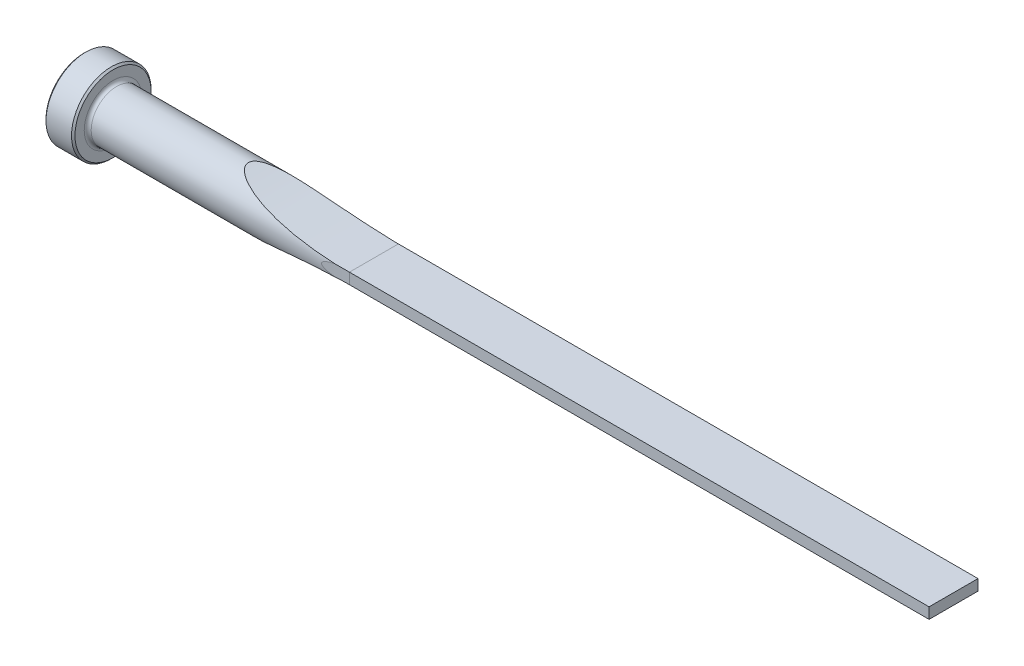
ISO-10303-21;
HEADER;
FILE_DESCRIPTION(('STEP AP214'),'2;1');
FILE_NAME('part.step','',(''),(''),'','','');
FILE_SCHEMA(('AUTOMOTIVE_DESIGN { 1 0 10303 214 1 1 1 1 }'));
ENDSEC;
DATA;
#1=APPLICATION_CONTEXT('core data for automotive mechanical design processes');
#2=APPLICATION_PROTOCOL_DEFINITION('international standard','automotive_design',2000,#1);
#3=PRODUCT_CONTEXT('',#1,'mechanical');
#4=PRODUCT('Part','Part','',(#3));
#5=PRODUCT_RELATED_PRODUCT_CATEGORY('part','',(#4));
#6=PRODUCT_DEFINITION_FORMATION('','',#4);
#7=PRODUCT_DEFINITION_CONTEXT('part definition',#1,'design');
#8=PRODUCT_DEFINITION('design','',#6,#7);
#9=PRODUCT_DEFINITION_SHAPE('','',#8);
#10=(LENGTH_UNIT() NAMED_UNIT(*) SI_UNIT(.MILLI.,.METRE.));
#11=(NAMED_UNIT(*) PLANE_ANGLE_UNIT() SI_UNIT($,.RADIAN.));
#12=(NAMED_UNIT(*) SI_UNIT($,.STERADIAN.) SOLID_ANGLE_UNIT());
#13=UNCERTAINTY_MEASURE_WITH_UNIT(LENGTH_MEASURE(1.E-05),#10,'distance_accuracy_value','');
#14=(GEOMETRIC_REPRESENTATION_CONTEXT(3) GLOBAL_UNCERTAINTY_ASSIGNED_CONTEXT((#13)) GLOBAL_UNIT_ASSIGNED_CONTEXT((#10,
#11,#12)) REPRESENTATION_CONTEXT('',''));
#15=CARTESIAN_POINT('',(0.,0.,0.));
#16=DIRECTION('',(0.,0.,1.));
#17=DIRECTION('',(1.,0.,0.));
#18=AXIS2_PLACEMENT_3D('',#15,#16,#17);
#19=CARTESIAN_POINT('',(0.,0.,0.));
#20=DIRECTION('',(-1.,0.,0.));
#21=DIRECTION('',(0.,0.,1.));
#22=AXIS2_PLACEMENT_3D('',#19,#20,#21);
#23=CYLINDRICAL_SURFACE('',#22,5.55625);
#24=CARTESIAN_POINT('',(7.112,0.,0.));
#25=DIRECTION('',(-1.,0.,0.));
#26=DIRECTION('',(0.,0.,1.));
#27=AXIS2_PLACEMENT_3D('',#24,#25,#26);
#28=CIRCLE('',#27,5.55625);
#29=CARTESIAN_POINT('',(7.112,0.,5.55625));
#30=VERTEX_POINT('',#29);
#31=EDGE_CURVE('E153',#30,#30,#28,.F.);
#32=ORIENTED_EDGE('',*,*,#31,.T.);
#33=EDGE_LOOP('',(#32));
#34=FACE_BOUND('',#33,.T.);
#35=CARTESIAN_POINT('',(63.5,1.46586005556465,5.3594));
#36=CARTESIAN_POINT('',(63.2302716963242,1.46575873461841,5.35939756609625));
#37=CARTESIAN_POINT('',(62.960518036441,1.46136420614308,5.36062746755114));
#38=CARTESIAN_POINT('',(62.4210592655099,1.44329060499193,5.36553852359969));
#39=CARTESIAN_POINT('',(62.1513545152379,1.42960160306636,5.36922229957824));
#40=CARTESIAN_POINT('',(61.6104951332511,1.39208721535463,5.37906724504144));
#41=CARTESIAN_POINT('',(61.3393463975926,1.36818081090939,5.38524819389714));
#42=CARTESIAN_POINT('',(60.798495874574,1.30859070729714,5.40004505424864));
#43=CARTESIAN_POINT('',(60.5287934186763,1.27291303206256,5.40865971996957));
#44=CARTESIAN_POINT('',(60.1266517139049,1.20828013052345,5.42332376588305));
#45=CARTESIAN_POINT('',(59.993273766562,1.18494144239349,5.42848992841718));
#46=CARTESIAN_POINT('',(59.7273373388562,1.13387487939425,5.43938691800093));
#47=CARTESIAN_POINT('',(59.5947790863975,1.10614583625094,5.44511789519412));
#48=CARTESIAN_POINT('',(59.3308411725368,1.0453518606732,5.45711645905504));
#49=CARTESIAN_POINT('',(59.1994619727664,1.01228492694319,5.46338424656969));
#50=CARTESIAN_POINT('',(58.9387100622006,0.939342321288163,5.47639670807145));
#51=CARTESIAN_POINT('',(58.8093360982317,0.899471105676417,5.48314106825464));
#52=CARTESIAN_POINT('',(58.5529739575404,0.81017572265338,5.49705768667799));
#53=CARTESIAN_POINT('',(58.4260027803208,0.760700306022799,5.50423209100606));
#54=CARTESIAN_POINT('',(58.2406002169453,0.67563860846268,5.51508991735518));
#55=CARTESIAN_POINT('',(58.1796837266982,0.645502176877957,5.51872258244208));
#56=CARTESIAN_POINT('',(58.0605030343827,0.580424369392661,5.52594854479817));
#57=CARTESIAN_POINT('',(58.002234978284,0.545490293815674,5.52954189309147));
#58=CARTESIAN_POINT('',(57.9015308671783,0.476724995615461,5.53584531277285));
#59=CARTESIAN_POINT('',(57.8582790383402,0.444104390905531,5.53858683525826));
#60=CARTESIAN_POINT('',(57.7766727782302,0.373234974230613,5.54381419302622));
#61=CARTESIAN_POINT('',(57.7382967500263,0.335012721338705,5.5463011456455));
#62=CARTESIAN_POINT('',(57.6879313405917,0.272690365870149,5.54959140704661));
#63=CARTESIAN_POINT('',(57.6725065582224,0.251407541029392,5.55060383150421));
#64=CARTESIAN_POINT('',(57.6446206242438,0.20692699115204,5.55244015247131));
#65=CARTESIAN_POINT('',(57.6321597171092,0.183729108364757,5.55326403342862));
#66=CARTESIAN_POINT('',(57.6111077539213,0.135176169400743,5.55465907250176));
#67=CARTESIAN_POINT('',(57.6025753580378,0.109794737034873,5.5552263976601));
#68=CARTESIAN_POINT('',(57.590813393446,0.0578395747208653,5.55600913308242));
#69=CARTESIAN_POINT('',(57.5875704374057,0.0312690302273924,5.55622543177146));
#70=CARTESIAN_POINT('',(57.5869422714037,-0.0180209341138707,5.55626732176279));
#71=CARTESIAN_POINT('',(57.5887666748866,-0.0407328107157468,5.55614563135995));
#72=CARTESIAN_POINT('',(57.5963953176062,-0.085481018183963,5.55563758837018));
#73=CARTESIAN_POINT('',(57.602204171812,-0.107516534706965,5.5552509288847));
#74=CARTESIAN_POINT('',(57.6191681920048,-0.156049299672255,5.5541244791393));
#75=CARTESIAN_POINT('',(57.6313303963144,-0.182187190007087,5.55331838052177));
#76=CARTESIAN_POINT('',(57.6596025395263,-0.232205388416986,5.55145244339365));
#77=CARTESIAN_POINT('',(57.6757208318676,-0.256080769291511,5.55039206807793));
#78=CARTESIAN_POINT('',(57.7237520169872,-0.31866699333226,5.54724818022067));
#79=CARTESIAN_POINT('',(57.7584842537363,-0.35517484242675,5.54499107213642));
#80=CARTESIAN_POINT('',(57.8325915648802,-0.423044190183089,5.54022572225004));
#81=CARTESIAN_POINT('',(57.8719807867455,-0.454389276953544,5.5377167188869));
#82=CARTESIAN_POINT('',(57.9740801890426,-0.527971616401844,5.53128741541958));
#83=CARTESIAN_POINT('',(58.0385427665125,-0.567741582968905,5.52729286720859));
#84=CARTESIAN_POINT('',(58.1708729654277,-0.641234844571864,5.51924650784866));
#85=CARTESIAN_POINT('',(58.2387481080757,-0.674943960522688,5.51519458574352));
#86=CARTESIAN_POINT('',(58.3769244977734,-0.738013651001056,5.50711039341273));
#87=CARTESIAN_POINT('',(58.4472370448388,-0.767349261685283,5.50307835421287));
#88=CARTESIAN_POINT('',(58.5891428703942,-0.822439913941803,5.49511361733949));
#89=CARTESIAN_POINT('',(58.6607346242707,-0.848198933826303,5.49118081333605));
#90=CARTESIAN_POINT('',(58.8693527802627,-0.918674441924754,5.47997799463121));
#91=CARTESIAN_POINT('',(59.0076205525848,-0.959734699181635,5.47287002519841));
#92=CARTESIAN_POINT('',(59.2861652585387,-1.03455813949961,5.45921359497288));
#93=CARTESIAN_POINT('',(59.426443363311,-1.06831686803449,5.45266547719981));
#94=CARTESIAN_POINT('',(59.8497352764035,-1.16124457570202,5.43392318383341));
#95=CARTESIAN_POINT('',(60.1346569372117,-1.21189726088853,5.42266076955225));
#96=CARTESIAN_POINT('',(60.7068394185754,-1.29737509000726,5.40282806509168));
#97=CARTESIAN_POINT('',(60.9941005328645,-1.33219821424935,5.39425811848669));
#98=CARTESIAN_POINT('',(61.569614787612,-1.38906505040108,5.37989532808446));
#99=CARTESIAN_POINT('',(61.8578664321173,-1.41112322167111,5.37409934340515));
#100=CARTESIAN_POINT('',(62.3722842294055,-1.44058275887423,5.3662659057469));
#101=CARTESIAN_POINT('',(62.5983257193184,-1.45012786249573,5.36368531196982));
#102=CARTESIAN_POINT('',(63.0495792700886,-1.46273038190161,5.3602558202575));
#103=CARTESIAN_POINT('',(63.2747904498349,-1.46581699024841,5.35939913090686));
#104=CARTESIAN_POINT('',(63.5,-1.46586005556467,5.3594));
#105=B_SPLINE_CURVE_WITH_KNOTS('',3,(#35,#36,#37,#38,#39,#40,#41,#42,#43,#44,#45,#46,#47,#48,
#49,#50,#51,#52,#53,#54,#55,#56,#57,#58,#59,#60,#61,#62,#63,#64,#65,#66,#67,#68,#69,#70,#71,#72,
#73,#74,#75,#76,#77,#78,#79,#80,#81,#82,#83,#84,#85,#86,#87,#88,#89,#90,#91,#92,#93,#94,#95,#96,
#97,#98,#99,#100,#101,#102,#103,#104),.UNSPECIFIED.,.F.,.F.,(4,2,2,2,2,2,2,2,2,2,2,2,2,2,2,2,2,
2,2,2,2,2,2,2,2,2,2,2,2,2,2,2,2,2,4),(0.,0.809188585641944,1.61924298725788,2.43584347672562,
3.25202671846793,3.65847781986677,4.06503726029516,4.47174948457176,4.87819635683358,
5.28687485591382,5.49092082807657,5.69465968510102,5.85711909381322,6.01883176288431,
6.09756631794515,6.17630736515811,6.25618880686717,6.33586775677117,6.40384405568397,
6.47189922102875,6.55793486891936,6.64415377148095,6.79462229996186,6.94556028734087,
7.17253298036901,7.40002994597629,7.62877945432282,7.85727244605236,8.2901786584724,
8.72334823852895,9.5914082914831,10.4595790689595,11.3267645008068,12.0054446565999,
12.6810504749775),.UNSPECIFIED.);
#106=CARTESIAN_POINT('',(60.3804206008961,1.24855125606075,5.41415125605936));
#107=VERTEX_POINT('',#106);
#108=CARTESIAN_POINT('',(60.3804206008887,-1.24855125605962,5.41415125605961));
#109=VERTEX_POINT('',#108);
#110=EDGE_CURVE('E156',#107,#109,#105,.T.);
#111=ORIENTED_EDGE('',*,*,#110,.F.);
#112=CARTESIAN_POINT('',(63.5,1.19379999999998,5.42648648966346));
#113=CARTESIAN_POINT('',(63.0362787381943,1.1937996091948,5.42647003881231));
#114=CARTESIAN_POINT('',(62.5725570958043,1.19742828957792,5.42568766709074));
#115=CARTESIAN_POINT('',(61.6452305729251,1.21194105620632,5.42247326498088));
#116=CARTESIAN_POINT('',(61.1816256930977,1.22282518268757,5.42004122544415));
#117=CARTESIAN_POINT('',(60.25456158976,1.25184904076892,5.41340899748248));
#118=CARTESIAN_POINT('',(59.7911024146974,1.26999023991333,5.40920845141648));
#119=CARTESIAN_POINT('',(58.8645475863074,1.31352246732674,5.39880331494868));
#120=CARTESIAN_POINT('',(58.4014519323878,1.33891348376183,5.39259872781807));
#121=CARTESIAN_POINT('',(57.4746189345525,1.39700801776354,5.3778418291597));
#122=CARTESIAN_POINT('',(57.0108827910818,1.42972926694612,5.3692838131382));
#123=CARTESIAN_POINT('',(56.0840401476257,1.50243687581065,5.34939418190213));
#124=CARTESIAN_POINT('',(55.6209336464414,1.54242322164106,5.33806257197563));
#125=CARTESIAN_POINT('',(54.6955412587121,1.62964076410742,5.31208608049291));
#126=CARTESIAN_POINT('',(54.2332552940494,1.67687122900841,5.29744153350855));
#127=CARTESIAN_POINT('',(53.3096282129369,1.77855677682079,5.26417167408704));
#128=CARTESIAN_POINT('',(52.8482870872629,1.83301178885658,5.24554640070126));
#129=CARTESIAN_POINT('',(51.6627492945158,1.982375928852,5.19149175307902));
#130=CARTESIAN_POINT('',(50.9393692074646,2.08258931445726,5.1525481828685));
#131=CARTESIAN_POINT('',(49.4961544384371,2.30066319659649,5.05895286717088));
#132=CARTESIAN_POINT('',(48.7763201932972,2.41852581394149,5.00429923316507));
#133=CARTESIAN_POINT('',(47.7002084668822,2.60831906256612,4.90648551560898));
#134=CARTESIAN_POINT('',(47.3420552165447,2.67376132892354,4.87123528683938));
#135=CARTESIAN_POINT('',(46.6272204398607,2.80891244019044,4.79457790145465));
#136=CARTESIAN_POINT('',(46.2705388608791,2.87862113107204,4.75317096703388));
#137=CARTESIAN_POINT('',(45.5590122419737,3.0222050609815,4.6631927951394));
#138=CARTESIAN_POINT('',(45.2041667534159,3.09607922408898,4.61462340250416));
#139=CARTESIAN_POINT('',(44.4966165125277,3.24788864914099,4.509067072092));
#140=CARTESIAN_POINT('',(44.1439116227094,3.32582364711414,4.45208068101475));
#141=CARTESIAN_POINT('',(43.4402644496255,3.4857894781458,4.32798668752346));
#142=CARTESIAN_POINT('',(43.0893286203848,3.56782989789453,4.26085457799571));
#143=CARTESIAN_POINT('',(42.3907815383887,3.73559284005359,4.11456616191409));
#144=CARTESIAN_POINT('',(42.0431707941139,3.82131591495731,4.03540804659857));
#145=CARTESIAN_POINT('',(41.3534736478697,3.99578955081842,3.86272579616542));
#146=CARTESIAN_POINT('',(41.0113731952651,4.08452961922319,3.76924813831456));
#147=CARTESIAN_POINT('',(40.5029301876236,4.21961545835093,3.61543612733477));
#148=CARTESIAN_POINT('',(40.3342561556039,4.26496713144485,3.56190764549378));
#149=CARTESIAN_POINT('',(39.9987815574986,4.35621823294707,3.44971264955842));
#150=CARTESIAN_POINT('',(39.8319808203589,4.40211761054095,3.39104660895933));
#151=CARTESIAN_POINT('',(39.5196683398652,4.4890286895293,3.27493062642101));
#152=CARTESIAN_POINT('',(39.3739098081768,4.52999694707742,3.21811345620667));
#153=CARTESIAN_POINT('',(39.0845836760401,4.61210575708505,3.09929221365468));
#154=CARTESIAN_POINT('',(38.9410158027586,4.65324628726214,3.03728879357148));
#155=CARTESIAN_POINT('',(38.6558597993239,4.73572579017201,2.90702443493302));
#156=CARTESIAN_POINT('',(38.5142851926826,4.77706472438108,2.83873370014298));
#157=CARTESIAN_POINT('',(38.2346051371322,4.85946967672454,2.69523964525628));
#158=CARTESIAN_POINT('',(38.0964991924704,4.90053573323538,2.62003732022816));
#159=CARTESIAN_POINT('',(37.8225864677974,4.98268911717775,2.46027026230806));
#160=CARTESIAN_POINT('',(37.6868524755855,5.02376614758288,2.37557431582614));
#161=CARTESIAN_POINT('',(37.4215073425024,5.10473330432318,2.19620380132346));
#162=CARTESIAN_POINT('',(37.291901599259,5.14462237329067,2.10152066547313));
#163=CARTESIAN_POINT('',(37.0424200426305,5.22199445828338,1.90109250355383));
#164=CARTESIAN_POINT('',(36.9224760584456,5.2594938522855,1.79543978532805));
#165=CARTESIAN_POINT('',(36.6952730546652,5.33100920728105,1.57040353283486));
#166=CARTESIAN_POINT('',(36.5879841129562,5.36503335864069,1.45105375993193));
#167=CARTESIAN_POINT('',(36.4210203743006,5.41827719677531,1.23397684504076));
#168=CARTESIAN_POINT('',(36.3566354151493,5.43890352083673,1.14025492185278));
#169=CARTESIAN_POINT('',(36.2403051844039,5.47629138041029,0.944493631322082));
#170=CARTESIAN_POINT('',(36.1883608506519,5.49305262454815,0.842453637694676));
#171=CARTESIAN_POINT('',(36.1002998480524,5.52153134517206,0.629482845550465));
#172=CARTESIAN_POINT('',(36.0643751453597,5.53318761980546,0.518462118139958));
#173=CARTESIAN_POINT('',(36.0133120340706,5.54977153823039,0.291274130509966));
#174=CARTESIAN_POINT('',(35.9981383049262,5.5547106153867,0.175115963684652));
#175=CARTESIAN_POINT('',(35.9909471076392,5.5570505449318,-0.0464774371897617));
#176=CARTESIAN_POINT('',(35.9967908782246,5.55514764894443,-0.151838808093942));
#177=CARTESIAN_POINT('',(36.0262526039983,5.5455686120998,-0.359780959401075));
#178=CARTESIAN_POINT('',(36.0498845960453,5.53788791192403,-0.462359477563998));
#179=CARTESIAN_POINT('',(36.1190753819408,5.515454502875,-0.682944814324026));
#180=CARTESIAN_POINT('',(36.1681812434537,5.4995603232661,-0.799703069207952));
#181=CARTESIAN_POINT('',(36.2835728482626,5.46236530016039,-1.02343794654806));
#182=CARTESIAN_POINT('',(36.3498921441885,5.44105389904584,-1.13039490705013));
#183=CARTESIAN_POINT('',(36.4814328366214,5.39898975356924,-1.31531443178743));
#184=CARTESIAN_POINT('',(36.5445462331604,5.37887596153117,-1.39496146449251));
#185=CARTESIAN_POINT('',(36.6772025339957,5.33678035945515,-1.54822827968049));
#186=CARTESIAN_POINT('',(36.7467497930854,5.31479728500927,-1.62184391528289));
#187=CARTESIAN_POINT('',(36.8909456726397,5.26942876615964,-1.76368634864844));
#188=CARTESIAN_POINT('',(36.9656040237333,5.24604065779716,-1.83190230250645));
#189=CARTESIAN_POINT('',(37.1188279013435,5.19827477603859,-1.96334885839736));
#190=CARTESIAN_POINT('',(37.1973925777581,5.17389721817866,-2.02658053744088));
#191=CARTESIAN_POINT('',(37.3805124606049,5.11736813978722,-2.1660165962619));
#192=CARTESIAN_POINT('',(37.486090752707,5.08498201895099,-2.24077876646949));
#193=CARTESIAN_POINT('',(37.7012459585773,5.01943855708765,-2.38397431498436));
#194=CARTESIAN_POINT('',(37.8108244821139,4.98628090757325,-2.45240510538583));
#195=CARTESIAN_POINT('',(38.144515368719,4.88603485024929,-2.64961446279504));
#196=CARTESIAN_POINT('',(38.3733168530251,4.81825572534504,-2.77011541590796));
#197=CARTESIAN_POINT('',(38.8400743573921,4.68210518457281,-2.99450065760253));
#198=CARTESIAN_POINT('',(39.0780706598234,4.61373250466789,-3.09829825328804));
#199=CARTESIAN_POINT('',(39.4392238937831,4.51164813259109,-3.24351905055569));
#200=CARTESIAN_POINT('',(39.5602534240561,4.47771225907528,-3.29016389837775));
#201=CARTESIAN_POINT('',(39.8035394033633,4.41005771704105,-3.38030843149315));
#202=CARTESIAN_POINT('',(39.9257958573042,4.37633904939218,-3.42380810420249));
#203=CARTESIAN_POINT('',(40.247047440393,4.28848246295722,-3.53389507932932));
#204=CARTESIAN_POINT('',(40.4468924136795,4.23456967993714,-3.59818566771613));
#205=CARTESIAN_POINT('',(40.848791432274,4.12766698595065,-3.72032881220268));
#206=CARTESIAN_POINT('',(41.050845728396,4.07467718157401,-3.77818062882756));
#207=CARTESIAN_POINT('',(41.6598643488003,3.91727056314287,-3.94336872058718));
#208=CARTESIAN_POINT('',(42.0695359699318,3.81445719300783,-4.04228829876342));
#209=CARTESIAN_POINT('',(42.8946456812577,3.61368582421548,-4.22271910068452));
#210=CARTESIAN_POINT('',(43.310093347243,3.51573754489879,-4.30419647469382));
#211=CARTESIAN_POINT('',(44.1447952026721,3.32531890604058,-4.45294934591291));
#212=CARTESIAN_POINT('',(44.5640498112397,3.23284915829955,-4.52022325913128));
#213=CARTESIAN_POINT('',(45.4069579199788,3.05336000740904,-4.64335849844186));
#214=CARTESIAN_POINT('',(45.8306217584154,2.96636114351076,-4.69917841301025));
#215=CARTESIAN_POINT('',(46.6803032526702,2.79835129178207,-4.80112404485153));
#216=CARTESIAN_POINT('',(47.1063210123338,2.7173405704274,-4.8472493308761));
#217=CARTESIAN_POINT('',(47.9597817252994,2.56152263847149,-4.93136301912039));
#218=CARTESIAN_POINT('',(48.3872225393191,2.48670855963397,-4.96936050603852));
#219=CARTESIAN_POINT('',(49.2436876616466,2.34326667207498,-5.0385861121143));
#220=CARTESIAN_POINT('',(49.6727119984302,2.27463897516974,-5.0698141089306));
#221=CARTESIAN_POINT('',(50.6601650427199,2.12410662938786,-5.13504521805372));
#222=CARTESIAN_POINT('',(51.2190490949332,2.04434163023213,-5.16710113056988));
#223=CARTESIAN_POINT('',(52.3386179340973,1.89542994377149,-5.22356084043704));
#224=CARTESIAN_POINT('',(52.8993027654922,1.82628352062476,-5.24796444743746));
#225=CARTESIAN_POINT('',(54.0223914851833,1.69863893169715,-5.29065870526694));
#226=CARTESIAN_POINT('',(54.5847960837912,1.64014602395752,-5.30894634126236));
#227=CARTESIAN_POINT('',(55.7107553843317,1.53389122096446,-5.34061439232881));
#228=CARTESIAN_POINT('',(56.2743100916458,1.48612937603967,-5.35399478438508));
#229=CARTESIAN_POINT('',(57.3925380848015,1.4020990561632,-5.37660600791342));
#230=CARTESIAN_POINT('',(57.9471961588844,1.36564586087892,-5.38590468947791));
#231=CARTESIAN_POINT('',(59.0571427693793,1.30314736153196,-5.40136553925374));
#232=CARTESIAN_POINT('',(59.6124313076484,1.27710208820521,-5.40752769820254));
#233=CARTESIAN_POINT('',(60.7230008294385,1.23544750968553,-5.41720096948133));
#234=CARTESIAN_POINT('',(61.2782815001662,1.21983031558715,-5.42071408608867));
#235=CARTESIAN_POINT('',(62.3890417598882,1.19900621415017,-5.42533985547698));
#236=CARTESIAN_POINT('',(62.9445213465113,1.193799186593,-5.42645253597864));
#237=CARTESIAN_POINT('',(63.5,1.19379999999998,-5.42648648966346));
#238=B_SPLINE_CURVE_WITH_KNOTS('',3,(#112,#113,#114,#115,#116,#117,#118,#119,#120,#121,#122,
#123,#124,#125,#126,#127,#128,#129,#130,#131,#132,#133,#134,#135,#136,#137,#138,#139,#140,#141,
#142,#143,#144,#145,#146,#147,#148,#149,#150,#151,#152,#153,#154,#155,#156,#157,#158,#159,#160,
#161,#162,#163,#164,#165,#166,#167,#168,#169,#170,#171,#172,#173,#174,#175,#176,#177,#178,#179,
#180,#181,#182,#183,#184,#185,#186,#187,#188,#189,#190,#191,#192,#193,#194,#195,#196,#197,#198,
#199,#200,#201,#202,#203,#204,#205,#206,#207,#208,#209,#210,#211,#212,#213,#214,#215,#216,#217,
#218,#219,#220,#221,#222,#223,#224,#225,#226,#227,#228,#229,#230,#231,#232,#233,#234,#235,#236,
#237),.UNSPECIFIED.,.F.,.F.,(4,2,2,2,2,2,2,2,2,2,2,2,2,2,2,2,2,2,2,2,2,2,2,2,2,2,2,2,2,2,2,2,2,
2,2,2,2,2,2,2,2,2,2,2,2,2,2,2,2,2,2,2,2,2,2,2,2,2,2,2,2,2,4),(0.,1.39114954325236,
2.78230680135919,4.17374552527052,5.5651819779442,6.96002133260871,8.35485802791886,
9.74955392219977,11.1442361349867,13.3378673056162,15.5317622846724,16.629054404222,
17.7263069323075,18.8232773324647,19.9201765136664,21.0197689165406,22.1195268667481,
23.2157881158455,23.7637714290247,24.3117042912,24.7967694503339,25.2817736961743,
25.7692080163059,26.2565722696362,26.7517811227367,27.2474183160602,27.7391790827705,
28.229752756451,28.5756325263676,28.9215383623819,29.2714846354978,29.6208345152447,
29.9356852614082,30.2507847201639,30.6316520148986,31.0132673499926,31.3236142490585,
31.6341727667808,31.9453399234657,32.2564396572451,32.6562491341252,33.0562213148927,
33.8571806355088,34.6621715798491,35.0643534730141,35.4665369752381,36.1166299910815,
36.7667975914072,38.0676169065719,39.370938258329,40.6744048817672,41.9825041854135,
43.290661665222,44.5973492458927,45.9040604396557,47.6002551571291,49.2964920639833,
50.9935638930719,52.6906436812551,54.3583330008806,56.0260272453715,57.6924584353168,
59.358870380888),.UNSPECIFIED.);
#239=CARTESIAN_POINT('',(60.3804206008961,1.24855125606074,-5.41415125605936));
#240=VERTEX_POINT('',#239);
#241=EDGE_CURVE('E106',#107,#240,#238,.T.);
#242=ORIENTED_EDGE('',*,*,#241,.T.);
#243=CARTESIAN_POINT('',(63.5,1.46586005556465,-5.3594));
#244=CARTESIAN_POINT('',(63.2302716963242,1.46575873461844,-5.35939756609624));
#245=CARTESIAN_POINT('',(62.960518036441,1.46136420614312,-5.36062746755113));
#246=CARTESIAN_POINT('',(62.4210592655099,1.44329060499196,-5.36553852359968));
#247=CARTESIAN_POINT('',(62.1513545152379,1.42960160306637,-5.36922229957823));
#248=CARTESIAN_POINT('',(61.6104951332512,1.39208721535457,-5.37906724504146));
#249=CARTESIAN_POINT('',(61.3393463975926,1.36818081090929,-5.38524819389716));
#250=CARTESIAN_POINT('',(60.798495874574,1.30859070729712,-5.40004505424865));
#251=CARTESIAN_POINT('',(60.5287934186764,1.27291303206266,-5.40865971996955));
#252=CARTESIAN_POINT('',(60.126651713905,1.20828013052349,-5.42332376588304));
#253=CARTESIAN_POINT('',(59.9932737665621,1.18494144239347,-5.42848992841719));
#254=CARTESIAN_POINT('',(59.7273373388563,1.13387487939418,-5.43938691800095));
#255=CARTESIAN_POINT('',(59.5947790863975,1.10614583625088,-5.44511789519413));
#256=CARTESIAN_POINT('',(59.3308411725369,1.0453518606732,-5.45711645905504));
#257=CARTESIAN_POINT('',(59.1994619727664,1.01228492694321,-5.46338424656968));
#258=CARTESIAN_POINT('',(58.9387100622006,0.939342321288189,-5.47639670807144));
#259=CARTESIAN_POINT('',(58.8093360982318,0.899471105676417,-5.48314106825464));
#260=CARTESIAN_POINT('',(58.5529739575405,0.810175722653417,-5.49705768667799));
#261=CARTESIAN_POINT('',(58.4260027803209,0.760700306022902,-5.50423209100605));
#262=CARTESIAN_POINT('',(58.2406002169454,0.675638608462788,-5.51508991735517));
#263=CARTESIAN_POINT('',(58.1796837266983,0.645502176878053,-5.51872258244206));
#264=CARTESIAN_POINT('',(58.0605030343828,0.580424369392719,-5.52594854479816));
#265=CARTESIAN_POINT('',(58.0022349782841,0.545490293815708,-5.52954189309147));
#266=CARTESIAN_POINT('',(57.9015308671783,0.476724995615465,-5.53584531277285));
#267=CARTESIAN_POINT('',(57.8582790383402,0.444104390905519,-5.53858683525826));
#268=CARTESIAN_POINT('',(57.7766727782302,0.373234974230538,-5.54381419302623));
#269=CARTESIAN_POINT('',(57.7382967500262,0.335012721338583,-5.5463011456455));
#270=CARTESIAN_POINT('',(57.6879313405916,0.272690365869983,-5.54959140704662));
#271=CARTESIAN_POINT('',(57.6725065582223,0.251407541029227,-5.55060383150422));
#272=CARTESIAN_POINT('',(57.6446206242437,0.20692699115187,-5.55244015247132));
#273=CARTESIAN_POINT('',(57.6321597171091,0.183729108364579,-5.55326403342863));
#274=CARTESIAN_POINT('',(57.6111077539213,0.135176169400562,-5.55465907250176));
#275=CARTESIAN_POINT('',(57.6025753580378,0.109794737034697,-5.55522639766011));
#276=CARTESIAN_POINT('',(57.590813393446,0.0578395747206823,-5.55600913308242));
#277=CARTESIAN_POINT('',(57.5875704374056,0.0312690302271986,-5.55622543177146));
#278=CARTESIAN_POINT('',(57.5869422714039,-0.018020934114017,-5.55626732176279));
#279=CARTESIAN_POINT('',(57.588766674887,-0.0407328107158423,-5.55614563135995));
#280=CARTESIAN_POINT('',(57.5963953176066,-0.0854810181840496,-5.55563758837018));
#281=CARTESIAN_POINT('',(57.6022041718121,-0.107516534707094,-5.55525092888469));
#282=CARTESIAN_POINT('',(57.6191681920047,-0.15604929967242,-5.55412447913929));
#283=CARTESIAN_POINT('',(57.6313303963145,-0.182187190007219,-5.55331838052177));
#284=CARTESIAN_POINT('',(57.6596025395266,-0.232205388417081,-5.55145244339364));
#285=CARTESIAN_POINT('',(57.6757208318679,-0.256080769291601,-5.55039206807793));
#286=CARTESIAN_POINT('',(57.7237520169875,-0.318666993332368,-5.54724818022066));
#287=CARTESIAN_POINT('',(57.7584842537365,-0.355174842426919,-5.54499107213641));
#288=CARTESIAN_POINT('',(57.8325915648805,-0.42304419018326,-5.54022572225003));
#289=CARTESIAN_POINT('',(57.8719807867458,-0.454389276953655,-5.53771671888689));
#290=CARTESIAN_POINT('',(57.974080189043,-0.527971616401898,-5.53128741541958));
#291=CARTESIAN_POINT('',(58.0385427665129,-0.567741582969,-5.52729286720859));
#292=CARTESIAN_POINT('',(58.1708729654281,-0.64123484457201,-5.51924650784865));
#293=CARTESIAN_POINT('',(58.2387481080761,-0.674943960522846,-5.5151945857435));
#294=CARTESIAN_POINT('',(58.3769244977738,-0.73801365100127,-5.5071103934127));
#295=CARTESIAN_POINT('',(58.4472370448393,-0.76734926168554,-5.50307835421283));
#296=CARTESIAN_POINT('',(58.5891428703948,-0.822439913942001,-5.49511361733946));
#297=CARTESIAN_POINT('',(58.6607346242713,-0.8481989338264,-5.49118081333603));
#298=CARTESIAN_POINT('',(58.8693527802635,-0.918674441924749,-5.47997799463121));
#299=CARTESIAN_POINT('',(59.0076205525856,-0.959734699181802,-5.47287002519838));
#300=CARTESIAN_POINT('',(59.2861652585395,-1.03455813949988,-5.45921359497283));
#301=CARTESIAN_POINT('',(59.4264433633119,-1.06831686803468,-5.45266547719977));
#302=CARTESIAN_POINT('',(59.8497352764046,-1.16124457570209,-5.43392318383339));
#303=CARTESIAN_POINT('',(60.1346569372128,-1.21189726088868,-5.42266076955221));
#304=CARTESIAN_POINT('',(60.7068394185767,-1.29737509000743,-5.40282806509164));
#305=CARTESIAN_POINT('',(60.9941005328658,-1.33219821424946,-5.39425811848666));
#306=CARTESIAN_POINT('',(61.5696147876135,-1.38906505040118,-5.37989532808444));
#307=CARTESIAN_POINT('',(61.8578664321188,-1.41112322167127,-5.37409934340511));
#308=CARTESIAN_POINT('',(62.3722842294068,-1.44058275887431,-5.36626590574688));
#309=CARTESIAN_POINT('',(62.5983257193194,-1.45012786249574,-5.36368531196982));
#310=CARTESIAN_POINT('',(63.0495792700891,-1.46273038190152,-5.36025582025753));
#311=CARTESIAN_POINT('',(63.2747904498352,-1.46581699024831,-5.35939913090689));
#312=CARTESIAN_POINT('',(63.5,-1.46586005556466,-5.3594));
#313=B_SPLINE_CURVE_WITH_KNOTS('',3,(#243,#244,#245,#246,#247,#248,#249,#250,#251,#252,#253,
#254,#255,#256,#257,#258,#259,#260,#261,#262,#263,#264,#265,#266,#267,#268,#269,#270,#271,#272,
#273,#274,#275,#276,#277,#278,#279,#280,#281,#282,#283,#284,#285,#286,#287,#288,#289,#290,#291,
#292,#293,#294,#295,#296,#297,#298,#299,#300,#301,#302,#303,#304,#305,#306,#307,#308,#309,#310,
#311,#312),.UNSPECIFIED.,.F.,.F.,(4,2,2,2,2,2,2,2,2,2,2,2,2,2,2,2,2,2,2,2,2,2,2,2,2,2,2,2,2,2,2,
2,2,2,4),(0.,0.809188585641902,1.61924298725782,2.43584347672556,3.25202671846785,
3.6584778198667,4.06503726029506,4.47174948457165,4.87819635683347,5.2868748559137,
5.49092082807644,5.69465968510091,5.85711909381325,6.0188317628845,6.09756631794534,
6.17630736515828,6.25618880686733,6.33586775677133,6.40384405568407,6.47189922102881,
6.55793486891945,6.6441537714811,6.79462229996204,6.94556028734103,7.17253298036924,
7.40002994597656,7.62877945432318,7.85727244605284,8.29017865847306,8.72334823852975,
9.59140829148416,10.4595790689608,11.3267645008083,12.0054446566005,12.6810504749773),.UNSPECIFIED.);
#314=CARTESIAN_POINT('',(60.3804206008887,-1.2485512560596,-5.41415125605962));
#315=VERTEX_POINT('',#314);
#316=EDGE_CURVE('E175',#240,#315,#313,.T.);
#317=ORIENTED_EDGE('',*,*,#316,.T.);
#318=CARTESIAN_POINT('',(63.5,-1.19379999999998,5.42648648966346));
#319=CARTESIAN_POINT('',(63.0362787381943,-1.19379960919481,5.42647003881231));
#320=CARTESIAN_POINT('',(62.5725570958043,-1.19742828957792,5.42568766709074));
#321=CARTESIAN_POINT('',(61.6452305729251,-1.21194105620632,5.42247326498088));
#322=CARTESIAN_POINT('',(61.1816256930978,-1.22282518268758,5.42004122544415));
#323=CARTESIAN_POINT('',(60.2545615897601,-1.25184904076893,5.41340899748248));
#324=CARTESIAN_POINT('',(59.7911024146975,-1.26999023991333,5.40920845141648));
#325=CARTESIAN_POINT('',(58.8645475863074,-1.31352246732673,5.39880331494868));
#326=CARTESIAN_POINT('',(58.4014519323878,-1.33891348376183,5.39259872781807));
#327=CARTESIAN_POINT('',(57.4746189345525,-1.39700801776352,5.3778418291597));
#328=CARTESIAN_POINT('',(57.0108827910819,-1.4297292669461,5.36928381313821));
#329=CARTESIAN_POINT('',(56.0840401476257,-1.50243687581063,5.34939418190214));
#330=CARTESIAN_POINT('',(55.6209336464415,-1.54242322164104,5.33806257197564));
#331=CARTESIAN_POINT('',(54.6955412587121,-1.6296407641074,5.31208608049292));
#332=CARTESIAN_POINT('',(54.2332552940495,-1.67687122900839,5.29744153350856));
#333=CARTESIAN_POINT('',(53.309628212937,-1.77855677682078,5.26417167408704));
#334=CARTESIAN_POINT('',(52.8482870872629,-1.8330117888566,5.24554640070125));
#335=CARTESIAN_POINT('',(51.6627492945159,-1.98237592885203,5.191491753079));
#336=CARTESIAN_POINT('',(50.9393692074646,-2.08258931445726,5.1525481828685));
#337=CARTESIAN_POINT('',(49.4961544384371,-2.30066319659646,5.05895286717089));
#338=CARTESIAN_POINT('',(48.7763201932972,-2.41852581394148,5.00429923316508));
#339=CARTESIAN_POINT('',(47.7002084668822,-2.60831906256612,4.90648551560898));
#340=CARTESIAN_POINT('',(47.3420552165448,-2.67376132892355,4.87123528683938));
#341=CARTESIAN_POINT('',(46.6272204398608,-2.80891244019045,4.79457790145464));
#342=CARTESIAN_POINT('',(46.2705388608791,-2.87862113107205,4.75317096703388));
#343=CARTESIAN_POINT('',(45.5590122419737,-3.0222050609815,4.6631927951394));
#344=CARTESIAN_POINT('',(45.2041667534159,-3.09607922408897,4.61462340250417));
#345=CARTESIAN_POINT('',(44.4966165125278,-3.24788864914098,4.50906707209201));
#346=CARTESIAN_POINT('',(44.1439116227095,-3.32582364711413,4.45208068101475));
#347=CARTESIAN_POINT('',(43.4402644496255,-3.4857894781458,4.32798668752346));
#348=CARTESIAN_POINT('',(43.0893286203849,-3.56782989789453,4.26085457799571));
#349=CARTESIAN_POINT('',(42.3907815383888,-3.7355928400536,4.11456616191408));
#350=CARTESIAN_POINT('',(42.043170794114,-3.82131591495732,4.03540804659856));
#351=CARTESIAN_POINT('',(41.3534736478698,-3.99578955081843,3.86272579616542));
#352=CARTESIAN_POINT('',(41.0113731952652,-4.08452961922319,3.76924813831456));
#353=CARTESIAN_POINT('',(40.5029301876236,-4.21961545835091,3.61543612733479));
#354=CARTESIAN_POINT('',(40.3342561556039,-4.26496713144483,3.56190764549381));
#355=CARTESIAN_POINT('',(39.9987815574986,-4.35621823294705,3.44971264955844));
#356=CARTESIAN_POINT('',(39.8319808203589,-4.40211761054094,3.39104660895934));
#357=CARTESIAN_POINT('',(39.5196683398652,-4.4890286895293,3.274930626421));
#358=CARTESIAN_POINT('',(39.3739098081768,-4.52999694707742,3.21811345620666));
#359=CARTESIAN_POINT('',(39.0845836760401,-4.61210575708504,3.09929221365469));
#360=CARTESIAN_POINT('',(38.9410158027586,-4.65324628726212,3.0372887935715));
#361=CARTESIAN_POINT('',(38.6558597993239,-4.735725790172,2.90702443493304));
#362=CARTESIAN_POINT('',(38.5142851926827,-4.77706472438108,2.83873370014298));
#363=CARTESIAN_POINT('',(38.2346051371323,-4.85946967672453,2.6952396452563));
#364=CARTESIAN_POINT('',(38.0964991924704,-4.90053573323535,2.62003732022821));
#365=CARTESIAN_POINT('',(37.8225864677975,-4.98268911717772,2.46027026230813));
#366=CARTESIAN_POINT('',(37.6868524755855,-5.02376614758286,2.37557431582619));
#367=CARTESIAN_POINT('',(37.4215073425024,-5.10473330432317,2.19620380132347));
#368=CARTESIAN_POINT('',(37.2919015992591,-5.14462237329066,2.10152066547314));
#369=CARTESIAN_POINT('',(37.0424200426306,-5.22199445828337,1.90109250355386));
#370=CARTESIAN_POINT('',(36.9224760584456,-5.25949385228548,1.7954397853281));
#371=CARTESIAN_POINT('',(36.6952730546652,-5.33100920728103,1.5704035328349));
#372=CARTESIAN_POINT('',(36.5879841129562,-5.36503335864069,1.45105375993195));
#373=CARTESIAN_POINT('',(36.4210203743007,-5.41827719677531,1.23397684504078));
#374=CARTESIAN_POINT('',(36.3566354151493,-5.43890352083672,1.14025492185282));
#375=CARTESIAN_POINT('',(36.2403051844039,-5.47629138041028,0.944493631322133));
#376=CARTESIAN_POINT('',(36.1883608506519,-5.49305262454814,0.842453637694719));
#377=CARTESIAN_POINT('',(36.1002998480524,-5.52153134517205,0.6294828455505));
#378=CARTESIAN_POINT('',(36.0643751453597,-5.53318761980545,0.518462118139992));
#379=CARTESIAN_POINT('',(36.0133120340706,-5.54977153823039,0.291274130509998));
#380=CARTESIAN_POINT('',(35.9981383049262,-5.5547106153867,0.175115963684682));
#381=CARTESIAN_POINT('',(35.9909471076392,-5.5570505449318,-0.046477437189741));
#382=CARTESIAN_POINT('',(35.9967908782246,-5.55514764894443,-0.151838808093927));
#383=CARTESIAN_POINT('',(36.0262526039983,-5.54556861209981,-0.359780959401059));
#384=CARTESIAN_POINT('',(36.0498845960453,-5.53788791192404,-0.462359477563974));
#385=CARTESIAN_POINT('',(36.1190753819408,-5.515454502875,-0.682944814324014));
#386=CARTESIAN_POINT('',(36.1681812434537,-5.4995603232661,-0.799703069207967));
#387=CARTESIAN_POINT('',(36.2835728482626,-5.46236530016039,-1.02343794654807));
#388=CARTESIAN_POINT('',(36.3498921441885,-5.44105389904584,-1.13039490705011));
#389=CARTESIAN_POINT('',(36.4814328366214,-5.39898975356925,-1.31531443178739));
#390=CARTESIAN_POINT('',(36.5445462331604,-5.37887596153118,-1.39496146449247));
#391=CARTESIAN_POINT('',(36.6772025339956,-5.33678035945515,-1.54822827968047));
#392=CARTESIAN_POINT('',(36.7467497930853,-5.31479728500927,-1.62184391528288));
#393=CARTESIAN_POINT('',(36.8909456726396,-5.26942876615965,-1.76368634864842));
#394=CARTESIAN_POINT('',(36.9656040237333,-5.24604065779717,-1.8319023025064));
#395=CARTESIAN_POINT('',(37.1188279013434,-5.19827477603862,-1.96334885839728));
#396=CARTESIAN_POINT('',(37.197392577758,-5.17389721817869,-2.02658053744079));
#397=CARTESIAN_POINT('',(37.3805124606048,-5.11736813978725,-2.16601659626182));
#398=CARTESIAN_POINT('',(37.4860907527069,-5.08498201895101,-2.24077876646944));
#399=CARTESIAN_POINT('',(37.7012459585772,-5.01943855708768,-2.38397431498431));
#400=CARTESIAN_POINT('',(37.8108244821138,-4.98628090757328,-2.45240510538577));
#401=CARTESIAN_POINT('',(38.1445153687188,-4.88603485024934,-2.64961446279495));
#402=CARTESIAN_POINT('',(38.3733168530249,-4.81825572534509,-2.77011541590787));
#403=CARTESIAN_POINT('',(38.8400743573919,-4.68210518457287,-2.99450065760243));
#404=CARTESIAN_POINT('',(39.0780706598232,-4.61373250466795,-3.09829825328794));
#405=CARTESIAN_POINT('',(39.4392238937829,-4.51164813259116,-3.24351905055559));
#406=CARTESIAN_POINT('',(39.5602534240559,-4.47771225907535,-3.29016389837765));
#407=CARTESIAN_POINT('',(39.803539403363,-4.41005771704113,-3.38030843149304));
#408=CARTESIAN_POINT('',(39.9257958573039,-4.37633904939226,-3.42380810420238));
#409=CARTESIAN_POINT('',(40.2470474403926,-4.28848246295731,-3.53389507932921));
#410=CARTESIAN_POINT('',(40.4468924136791,-4.23456967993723,-3.59818566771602));
#411=CARTESIAN_POINT('',(40.8487914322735,-4.12766698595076,-3.72032881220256));
#412=CARTESIAN_POINT('',(41.0508457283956,-4.07467718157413,-3.77818062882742));
#413=CARTESIAN_POINT('',(41.6598643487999,-3.91727056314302,-3.94336872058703));
#414=CARTESIAN_POINT('',(42.0695359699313,-3.81445719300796,-4.04228829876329));
#415=CARTESIAN_POINT('',(42.8946456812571,-3.61368582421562,-4.2227191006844));
#416=CARTESIAN_POINT('',(43.3100933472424,-3.51573754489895,-4.30419647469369));
#417=CARTESIAN_POINT('',(44.1447952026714,-3.32531890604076,-4.45294934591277));
#418=CARTESIAN_POINT('',(44.5640498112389,-3.23284915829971,-4.52022325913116));
#419=CARTESIAN_POINT('',(45.406957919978,-3.0533600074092,-4.64335849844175));
#420=CARTESIAN_POINT('',(45.8306217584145,-2.96636114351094,-4.69917841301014));
#421=CARTESIAN_POINT('',(46.6803032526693,-2.79835129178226,-4.80112404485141));
#422=CARTESIAN_POINT('',(47.1063210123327,-2.7173405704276,-4.84724933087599));
#423=CARTESIAN_POINT('',(47.9597817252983,-2.5615226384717,-4.93136301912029));
#424=CARTESIAN_POINT('',(48.3872225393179,-2.48670855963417,-4.96936050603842));
#425=CARTESIAN_POINT('',(49.2436876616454,-2.34326667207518,-5.03858611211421));
#426=CARTESIAN_POINT('',(49.672711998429,-2.27463897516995,-5.0698141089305));
#427=CARTESIAN_POINT('',(50.6601650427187,-2.12410662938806,-5.13504521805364));
#428=CARTESIAN_POINT('',(51.219049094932,-2.04434163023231,-5.16710113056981));
#429=CARTESIAN_POINT('',(52.3386179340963,-1.89542994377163,-5.22356084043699));
#430=CARTESIAN_POINT('',(52.8993027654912,-1.82628352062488,-5.24796444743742));
#431=CARTESIAN_POINT('',(54.0223914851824,-1.69863893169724,-5.29065870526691));
#432=CARTESIAN_POINT('',(54.5847960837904,-1.6401460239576,-5.30894634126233));
#433=CARTESIAN_POINT('',(55.710755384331,-1.53389122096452,-5.3406143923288));
#434=CARTESIAN_POINT('',(56.2743100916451,-1.48612937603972,-5.35399478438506));
#435=CARTESIAN_POINT('',(57.392538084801,-1.40209905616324,-5.37660600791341));
#436=CARTESIAN_POINT('',(57.9471961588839,-1.36564586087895,-5.38590468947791));
#437=CARTESIAN_POINT('',(59.0571427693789,-1.30314736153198,-5.40136553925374));
#438=CARTESIAN_POINT('',(59.612431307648,-1.27710208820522,-5.40752769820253));
#439=CARTESIAN_POINT('',(60.7230008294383,-1.23544750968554,-5.41720096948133));
#440=CARTESIAN_POINT('',(61.2782815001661,-1.21983031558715,-5.42071408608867));
#441=CARTESIAN_POINT('',(62.3890417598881,-1.19900621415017,-5.42533985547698));
#442=CARTESIAN_POINT('',(62.9445213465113,-1.193799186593,-5.42645253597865));
#443=CARTESIAN_POINT('',(63.5,-1.19379999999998,-5.42648648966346));
#444=B_SPLINE_CURVE_WITH_KNOTS('',3,(#318,#319,#320,#321,#322,#323,#324,#325,#326,#327,#328,
#329,#330,#331,#332,#333,#334,#335,#336,#337,#338,#339,#340,#341,#342,#343,#344,#345,#346,#347,
#348,#349,#350,#351,#352,#353,#354,#355,#356,#357,#358,#359,#360,#361,#362,#363,#364,#365,#366,
#367,#368,#369,#370,#371,#372,#373,#374,#375,#376,#377,#378,#379,#380,#381,#382,#383,#384,#385,
#386,#387,#388,#389,#390,#391,#392,#393,#394,#395,#396,#397,#398,#399,#400,#401,#402,#403,#404,
#405,#406,#407,#408,#409,#410,#411,#412,#413,#414,#415,#416,#417,#418,#419,#420,#421,#422,#423,
#424,#425,#426,#427,#428,#429,#430,#431,#432,#433,#434,#435,#436,#437,#438,#439,#440,#441,#442,
#443),.UNSPECIFIED.,.F.,.F.,(4,2,2,2,2,2,2,2,2,2,2,2,2,2,2,2,2,2,2,2,2,2,2,2,2,2,2,2,2,2,2,2,2,
2,2,2,2,2,2,2,2,2,2,2,2,2,2,2,2,2,2,2,2,2,2,2,2,2,2,2,2,2,4),(0.,1.39114954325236,
2.78230680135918,4.17374552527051,5.56518197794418,6.96002133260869,8.35485802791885,
9.74955392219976,11.1442361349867,13.3378673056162,15.5317622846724,16.629054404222,
17.7263069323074,18.8232773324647,19.9201765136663,21.0197689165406,22.1195268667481,
23.2157881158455,23.7637714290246,24.3117042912,24.7967694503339,25.2817736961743,
25.7692080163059,26.2565722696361,26.7517811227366,27.2474183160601,27.7391790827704,
28.2297527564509,28.5756325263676,28.9215383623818,29.2714846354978,29.6208345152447,
29.9356852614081,30.2507847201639,30.6316520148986,31.0132673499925,31.3236142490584,
31.6341727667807,31.9453399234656,32.256439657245,32.6562491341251,33.0562213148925,
33.8571806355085,34.6621715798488,35.0643534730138,35.4665369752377,36.1166299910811,
36.7667975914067,38.0676169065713,39.3709382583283,40.6744048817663,41.9825041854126,
43.290661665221,44.5973492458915,45.9040604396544,47.600255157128,49.2964920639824,
50.9935638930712,52.6906436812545,54.3583330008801,56.0260272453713,57.6924584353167,
59.358870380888),.UNSPECIFIED.);
#445=EDGE_CURVE('E105',#109,#315,#444,.T.);
#446=ORIENTED_EDGE('',*,*,#445,.F.);
#447=EDGE_LOOP('',(#111,#242,#317,#446));
#448=FACE_BOUND('',#447,.T.);
#449=ADVANCED_FACE('F33',(#34,#448),#23,.T.);
#450=CARTESIAN_POINT('',(190.5,5.55625,0.));
#451=DIRECTION('',(-1.,0.,0.));
#452=DIRECTION('',(0.,0.,1.));
#453=AXIS2_PLACEMENT_3D('',#450,#451,#452);
#454=PLANE('',#453);
#455=DIRECTION('',(0.,1.,0.));
#456=VECTOR('',#455,1.);
#457=CARTESIAN_POINT('',(190.5,-8.7249,5.3594));
#458=LINE('',#457,#456);
#459=CARTESIAN_POINT('',(190.5,-1.1938,5.3594));
#460=VERTEX_POINT('',#459);
#461=CARTESIAN_POINT('',(190.5,1.1938,5.3594));
#462=VERTEX_POINT('',#461);
#463=EDGE_CURVE('E87',#460,#462,#458,.T.);
#464=ORIENTED_EDGE('',*,*,#463,.F.);
#465=DIRECTION('',(0.,0.,1.));
#466=VECTOR('',#465,1.);
#467=CARTESIAN_POINT('',(190.5,-1.1938,0.));
#468=LINE('',#467,#466);
#469=CARTESIAN_POINT('',(190.5,-1.1938,-5.35939999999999));
#470=VERTEX_POINT('',#469);
#471=EDGE_CURVE('E100',#470,#460,#468,.T.);
#472=ORIENTED_EDGE('',*,*,#471,.F.);
#473=DIRECTION('',(0.,1.,0.));
#474=VECTOR('',#473,1.);
#475=CARTESIAN_POINT('',(190.5,-8.7249,-5.3594));
#476=LINE('',#475,#474);
#477=CARTESIAN_POINT('',(190.5,1.19379999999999,-5.3594));
#478=VERTEX_POINT('',#477);
#479=EDGE_CURVE('E56',#470,#478,#476,.T.);
#480=ORIENTED_EDGE('',*,*,#479,.T.);
#481=DIRECTION('',(0.,0.,1.));
#482=VECTOR('',#481,1.);
#483=CARTESIAN_POINT('',(190.5,1.1938,0.));
#484=LINE('',#483,#482);
#485=EDGE_CURVE('E102',#478,#462,#484,.T.);
#486=ORIENTED_EDGE('',*,*,#485,.T.);
#487=EDGE_LOOP('',(#464,#472,#480,#486));
#488=FACE_BOUND('',#487,.T.);
#489=ADVANCED_FACE('F99',(#488),#454,.F.);
#490=CARTESIAN_POINT('',(63.5,90.0938,-8.7249));
#491=DIRECTION('',(0.,0.,1.));
#492=DIRECTION('',(1.,0.,0.));
#493=AXIS2_PLACEMENT_3D('',#490,#491,#492);
#494=CYLINDRICAL_SURFACE('',#493,88.9);
#495=CARTESIAN_POINT('',(63.5,90.0938,94.2594));
#496=DIRECTION('',(0.,-0.707106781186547,0.707106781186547));
#497=DIRECTION('',(0.,0.707106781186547,0.707106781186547));
#498=AXIS2_PLACEMENT_3D('',#495,#496,#497);
#499=ELLIPSE('',#498,125.723585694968,88.9);
#500=CARTESIAN_POINT('',(63.5,1.19379999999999,5.35939999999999));
#501=VERTEX_POINT('',#500);
#502=EDGE_CURVE('E162',#501,#107,#499,.F.);
#503=ORIENTED_EDGE('',*,*,#502,.F.);
#504=DIRECTION('',(0.,0.,1.));
#505=VECTOR('',#504,1.);
#506=CARTESIAN_POINT('',(63.5,1.19379999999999,-8.7249));
#507=LINE('',#506,#505);
#508=CARTESIAN_POINT('',(63.5,1.1938,-5.35939999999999));
#509=VERTEX_POINT('',#508);
#510=EDGE_CURVE('E170',#509,#501,#507,.T.);
#511=ORIENTED_EDGE('',*,*,#510,.F.);
#512=CARTESIAN_POINT('',(63.5,90.0938,-94.2594));
#513=DIRECTION('',(0.,0.707106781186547,0.707106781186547));
#514=DIRECTION('',(0.,-0.707106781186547,0.707106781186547));
#515=AXIS2_PLACEMENT_3D('',#512,#513,#514);
#516=ELLIPSE('',#515,125.723585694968,88.9);
#517=EDGE_CURVE('E169',#509,#240,#516,.F.);
#518=ORIENTED_EDGE('',*,*,#517,.T.);
#519=ORIENTED_EDGE('',*,*,#241,.F.);
#520=EDGE_LOOP('',(#503,#511,#518,#519));
#521=FACE_BOUND('',#520,.T.);
#522=ADVANCED_FACE('F138',(#521),#494,.F.);
#523=CARTESIAN_POINT('',(190.5,1.1938,-8.7249));
#524=DIRECTION('',(0.,-1.,0.));
#525=DIRECTION('',(1.,0.,0.));
#526=AXIS2_PLACEMENT_3D('',#523,#524,#525);
#527=PLANE('',#526);
#528=DIRECTION('',(-1.,0.,0.));
#529=VECTOR('',#528,1.);
#530=CARTESIAN_POINT('',(190.5,1.1938,5.3594));
#531=LINE('',#530,#529);
#532=EDGE_CURVE('E188',#462,#501,#531,.T.);
#533=ORIENTED_EDGE('',*,*,#532,.F.);
#534=ORIENTED_EDGE('',*,*,#485,.F.);
#535=DIRECTION('',(-1.,0.,0.));
#536=VECTOR('',#535,1.);
#537=CARTESIAN_POINT('',(190.5,1.1938,-5.3594));
#538=LINE('',#537,#536);
#539=EDGE_CURVE('E174',#478,#509,#538,.T.);
#540=ORIENTED_EDGE('',*,*,#539,.T.);
#541=ORIENTED_EDGE('',*,*,#510,.T.);
#542=EDGE_LOOP('',(#533,#534,#540,#541));
#543=FACE_BOUND('',#542,.T.);
#544=ADVANCED_FACE('F129',(#543),#527,.F.);
#545=CARTESIAN_POINT('',(63.5,-90.0938,-8.7249));
#546=DIRECTION('',(0.,0.,1.));
#547=DIRECTION('',(1.,0.,0.));
#548=AXIS2_PLACEMENT_3D('',#545,#546,#547);
#549=CYLINDRICAL_SURFACE('',#548,88.9);
#550=DIRECTION('',(0.,0.,1.));
#551=VECTOR('',#550,1.);
#552=CARTESIAN_POINT('',(63.5,-1.19379999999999,-8.7249));
#553=LINE('',#552,#551);
#554=CARTESIAN_POINT('',(63.5,-1.1938,-5.35939999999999));
#555=VERTEX_POINT('',#554);
#556=CARTESIAN_POINT('',(63.5,-1.19379999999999,5.35939999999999));
#557=VERTEX_POINT('',#556);
#558=EDGE_CURVE('E178',#555,#557,#553,.T.);
#559=ORIENTED_EDGE('',*,*,#558,.T.);
#560=CARTESIAN_POINT('',(63.5,-90.0938,94.2594));
#561=DIRECTION('',(0.,0.707106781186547,0.707106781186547));
#562=DIRECTION('',(0.,-0.707106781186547,0.707106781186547));
#563=AXIS2_PLACEMENT_3D('',#560,#561,#562);
#564=ELLIPSE('',#563,125.723585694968,88.9);
#565=EDGE_CURVE('E163',#557,#109,#564,.T.);
#566=ORIENTED_EDGE('',*,*,#565,.T.);
#567=ORIENTED_EDGE('',*,*,#445,.T.);
#568=CARTESIAN_POINT('',(63.5,-90.0938,-94.2594));
#569=DIRECTION('',(0.,-0.707106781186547,0.707106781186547));
#570=DIRECTION('',(0.,0.707106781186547,0.707106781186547));
#571=AXIS2_PLACEMENT_3D('',#568,#569,#570);
#572=ELLIPSE('',#571,125.723585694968,88.9);
#573=EDGE_CURVE('E180',#555,#315,#572,.T.);
#574=ORIENTED_EDGE('',*,*,#573,.F.);
#575=EDGE_LOOP('',(#559,#566,#567,#574));
#576=FACE_BOUND('',#575,.T.);
#577=ADVANCED_FACE('F124',(#576),#549,.F.);
#578=CARTESIAN_POINT('',(190.5,-1.1938,-8.7249));
#579=DIRECTION('',(0.,-1.,0.));
#580=DIRECTION('',(1.,0.,0.));
#581=AXIS2_PLACEMENT_3D('',#578,#579,#580);
#582=PLANE('',#581);
#583=ORIENTED_EDGE('',*,*,#471,.T.);
#584=DIRECTION('',(-1.,0.,0.));
#585=VECTOR('',#584,1.);
#586=CARTESIAN_POINT('',(190.5,-1.1938,5.3594));
#587=LINE('',#586,#585);
#588=EDGE_CURVE('E84',#460,#557,#587,.T.);
#589=ORIENTED_EDGE('',*,*,#588,.T.);
#590=ORIENTED_EDGE('',*,*,#558,.F.);
#591=DIRECTION('',(-1.,0.,0.));
#592=VECTOR('',#591,1.);
#593=CARTESIAN_POINT('',(190.5,-1.1938,-5.3594));
#594=LINE('',#593,#592);
#595=EDGE_CURVE('E94',#470,#555,#594,.T.);
#596=ORIENTED_EDGE('',*,*,#595,.F.);
#597=EDGE_LOOP('',(#583,#589,#590,#596));
#598=FACE_BOUND('',#597,.T.);
#599=ADVANCED_FACE('F104',(#598),#582,.T.);
#600=CARTESIAN_POINT('',(0.,0.,0.));
#601=DIRECTION('',(1.,0.,0.));
#602=DIRECTION('',(0.,0.,-1.));
#603=AXIS2_PLACEMENT_3D('',#600,#601,#602);
#604=PLANE('',#603);
#605=CARTESIAN_POINT('',(0.,0.,0.));
#606=DIRECTION('',(1.,0.,0.));
#607=DIRECTION('',(0.,0.,-1.));
#608=AXIS2_PLACEMENT_3D('',#605,#606,#607);
#609=CIRCLE('',#608,8.34390000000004);
#610=CARTESIAN_POINT('',(0.,0.,-8.34390000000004));
#611=VERTEX_POINT('',#610);
#612=EDGE_CURVE('E239',#611,#611,#609,.F.);
#613=ORIENTED_EDGE('',*,*,#612,.T.);
#614=EDGE_LOOP('',(#613));
#615=FACE_BOUND('',#614,.T.);
#616=ADVANCED_FACE('F136',(#615),#604,.F.);
#617=CARTESIAN_POINT('',(0.,0.,0.));
#618=DIRECTION('',(-1.,0.,0.));
#619=DIRECTION('',(0.,0.,1.));
#620=AXIS2_PLACEMENT_3D('',#617,#618,#619);
#621=CYLINDRICAL_SURFACE('',#620,8.7249);
#622=CARTESIAN_POINT('',(0.38099999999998,0.,0.));
#623=DIRECTION('',(1.,0.,0.));
#624=DIRECTION('',(0.,0.,-1.));
#625=AXIS2_PLACEMENT_3D('',#622,#623,#624);
#626=CIRCLE('',#625,8.7249);
#627=CARTESIAN_POINT('',(0.38099999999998,0.,-8.7249));
#628=VERTEX_POINT('',#627);
#629=EDGE_CURVE('E41',#628,#628,#626,.T.);
#630=ORIENTED_EDGE('',*,*,#629,.T.);
#631=EDGE_LOOP('',(#630));
#632=FACE_BOUND('',#631,.T.);
#633=CARTESIAN_POINT('',(5.96900000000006,0.,0.));
#634=DIRECTION('',(-1.,0.,0.));
#635=DIRECTION('',(0.,0.,1.));
#636=AXIS2_PLACEMENT_3D('',#633,#634,#635);
#637=CIRCLE('',#636,8.7249);
#638=CARTESIAN_POINT('',(5.96900000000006,0.,8.7249));
#639=VERTEX_POINT('',#638);
#640=EDGE_CURVE('E240',#639,#639,#637,.T.);
#641=ORIENTED_EDGE('',*,*,#640,.T.);
#642=EDGE_LOOP('',(#641));
#643=FACE_BOUND('',#642,.T.);
#644=ADVANCED_FACE('F213',(#632,#643),#621,.T.);
#645=CARTESIAN_POINT('',(6.35,8.7249,0.));
#646=DIRECTION('',(-1.,0.,0.));
#647=DIRECTION('',(0.,0.,1.));
#648=AXIS2_PLACEMENT_3D('',#645,#646,#647);
#649=PLANE('',#648);
#650=CARTESIAN_POINT('',(6.35,0.,0.));
#651=DIRECTION('',(-1.,0.,0.));
#652=DIRECTION('',(0.,0.,1.));
#653=AXIS2_PLACEMENT_3D('',#650,#651,#652);
#654=CIRCLE('',#653,8.34390000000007);
#655=CARTESIAN_POINT('',(6.35,0.,8.34390000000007));
#656=VERTEX_POINT('',#655);
#657=EDGE_CURVE('E11',#656,#656,#654,.F.);
#658=ORIENTED_EDGE('',*,*,#657,.T.);
#659=EDGE_LOOP('',(#658));
#660=FACE_BOUND('',#659,.T.);
#661=CARTESIAN_POINT('',(6.35,0.,0.));
#662=DIRECTION('',(-1.,0.,0.));
#663=DIRECTION('',(0.,0.,1.));
#664=AXIS2_PLACEMENT_3D('',#661,#662,#663);
#665=CIRCLE('',#664,6.31825);
#666=CARTESIAN_POINT('',(6.35,0.,6.31825));
#667=VERTEX_POINT('',#666);
#668=EDGE_CURVE('E93',#667,#667,#665,.T.);
#669=ORIENTED_EDGE('',*,*,#668,.T.);
#670=EDGE_LOOP('',(#669));
#671=FACE_BOUND('',#670,.T.);
#672=ADVANCED_FACE('F208',(#660,#671),#649,.F.);
#673=CARTESIAN_POINT('',(190.5,-8.7249,-5.3594));
#674=DIRECTION('',(0.,0.,1.));
#675=DIRECTION('',(1.,0.,0.));
#676=AXIS2_PLACEMENT_3D('',#673,#674,#675);
#677=PLANE('',#676);
#678=ORIENTED_EDGE('',*,*,#479,.F.);
#679=ORIENTED_EDGE('',*,*,#595,.T.);
#680=DIRECTION('',(0.,1.,0.));
#681=VECTOR('',#680,1.);
#682=CARTESIAN_POINT('',(63.5,-8.7249,-5.35939999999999));
#683=LINE('',#682,#681);
#684=EDGE_CURVE('E190',#555,#509,#683,.T.);
#685=ORIENTED_EDGE('',*,*,#684,.T.);
#686=ORIENTED_EDGE('',*,*,#539,.F.);
#687=EDGE_LOOP('',(#678,#679,#685,#686));
#688=FACE_BOUND('',#687,.T.);
#689=ADVANCED_FACE('F189',(#688),#677,.F.);
#690=CARTESIAN_POINT('',(63.5,-8.7249,-94.2594));
#691=DIRECTION('',(0.,1.,0.));
#692=DIRECTION('',(0.,0.,1.));
#693=AXIS2_PLACEMENT_3D('',#690,#691,#692);
#694=CYLINDRICAL_SURFACE('',#693,88.9);
#695=ORIENTED_EDGE('',*,*,#684,.F.);
#696=ORIENTED_EDGE('',*,*,#573,.T.);
#697=ORIENTED_EDGE('',*,*,#316,.F.);
#698=ORIENTED_EDGE('',*,*,#517,.F.);
#699=EDGE_LOOP('',(#695,#696,#697,#698));
#700=FACE_BOUND('',#699,.T.);
#701=ADVANCED_FACE('F131',(#700),#694,.F.);
#702=CARTESIAN_POINT('',(63.5,-8.7249,94.2594));
#703=DIRECTION('',(0.,1.,0.));
#704=DIRECTION('',(0.,0.,1.));
#705=AXIS2_PLACEMENT_3D('',#702,#703,#704);
#706=CYLINDRICAL_SURFACE('',#705,88.9);
#707=ORIENTED_EDGE('',*,*,#502,.T.);
#708=ORIENTED_EDGE('',*,*,#110,.T.);
#709=ORIENTED_EDGE('',*,*,#565,.F.);
#710=DIRECTION('',(0.,1.,0.));
#711=VECTOR('',#710,1.);
#712=CARTESIAN_POINT('',(63.5,-8.7249,5.35939999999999));
#713=LINE('',#712,#711);
#714=EDGE_CURVE('E48',#557,#501,#713,.T.);
#715=ORIENTED_EDGE('',*,*,#714,.T.);
#716=EDGE_LOOP('',(#707,#708,#709,#715));
#717=FACE_BOUND('',#716,.T.);
#718=ADVANCED_FACE('F201',(#717),#706,.F.);
#719=CARTESIAN_POINT('',(190.5,-8.7249,5.3594));
#720=DIRECTION('',(0.,0.,1.));
#721=DIRECTION('',(1.,0.,0.));
#722=AXIS2_PLACEMENT_3D('',#719,#720,#721);
#723=PLANE('',#722);
#724=ORIENTED_EDGE('',*,*,#532,.T.);
#725=ORIENTED_EDGE('',*,*,#714,.F.);
#726=ORIENTED_EDGE('',*,*,#588,.F.);
#727=ORIENTED_EDGE('',*,*,#463,.T.);
#728=EDGE_LOOP('',(#724,#725,#726,#727));
#729=FACE_BOUND('',#728,.T.);
#730=ADVANCED_FACE('F86',(#729),#723,.T.);
#731=CARTESIAN_POINT('',(7.112,0.,0.));
#732=DIRECTION('',(-1.,0.,0.));
#733=DIRECTION('',(0.,0.,1.));
#734=AXIS2_PLACEMENT_3D('',#731,#732,#733);
#735=TOROIDAL_SURFACE('',#734,6.31825,0.762);
#736=ORIENTED_EDGE('',*,*,#31,.F.);
#737=EDGE_LOOP('',(#736));
#738=FACE_BOUND('',#737,.T.);
#739=ORIENTED_EDGE('',*,*,#668,.F.);
#740=EDGE_LOOP('',(#739));
#741=FACE_BOUND('',#740,.T.);
#742=ADVANCED_FACE('F206',(#738,#741),#735,.F.);
#743=CARTESIAN_POINT('',(0.,0.,0.));
#744=DIRECTION('',(1.,0.,0.));
#745=DIRECTION('',(0.,0.,-1.));
#746=AXIS2_PLACEMENT_3D('',#743,#744,#745);
#747=CONICAL_SURFACE('',#746,8.34390000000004,0.785398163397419);
#748=ORIENTED_EDGE('',*,*,#629,.F.);
#749=EDGE_LOOP('',(#748));
#750=FACE_BOUND('',#749,.T.);
#751=ORIENTED_EDGE('',*,*,#612,.F.);
#752=EDGE_LOOP('',(#751));
#753=FACE_BOUND('',#752,.T.);
#754=ADVANCED_FACE('F226',(#750,#753),#747,.T.);
#755=CARTESIAN_POINT('',(5.96900000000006,0.,0.));
#756=DIRECTION('',(-1.,0.,0.));
#757=DIRECTION('',(0.,0.,1.));
#758=AXIS2_PLACEMENT_3D('',#755,#756,#757);
#759=CONICAL_SURFACE('',#758,8.7249,0.785398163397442);
#760=ORIENTED_EDGE('',*,*,#657,.F.);
#761=EDGE_LOOP('',(#760));
#762=FACE_BOUND('',#761,.T.);
#763=ORIENTED_EDGE('',*,*,#640,.F.);
#764=EDGE_LOOP('',(#763));
#765=FACE_BOUND('',#764,.T.);
#766=ADVANCED_FACE('F35',(#762,#765),#759,.T.);
#767=CLOSED_SHELL('',(#449,#489,#522,#544,#577,#599,#616,#644,#672,#689,#701,#718,#730,#742,
#754,#766));
#768=MANIFOLD_SOLID_BREP('B2',#767);
#769=ADVANCED_BREP_SHAPE_REPRESENTATION('',(#18,#768),#14);
#770=SHAPE_DEFINITION_REPRESENTATION(#9,#769);
ENDSEC;
END-ISO-10303-21;
